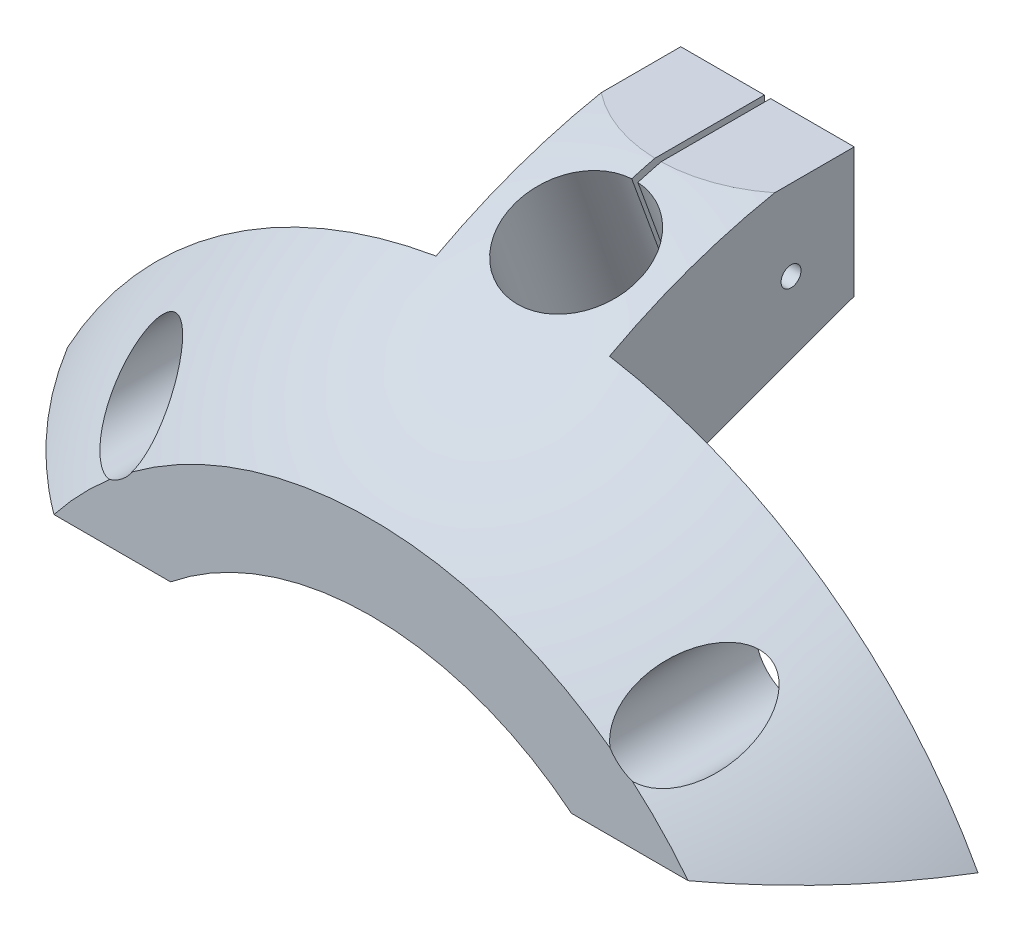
from build123d import *

# Parameters (mm, degrees)
SKETCH1_W                  = 304.8
SKETCH1_H                  = 304.8
EXTRUDE1_DEPTH             = 152.4
CUT_EXTRUDE2_DEPTH         = 264.964543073
CUT_EXTRUDE2_DEPTH_BACK    = 264.964543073
SKETCH4_OUTSIDE_W          = 398.24
SKETCH4_OUTSIDE_H          = 245.84
CUT_EXTRUDE3_DEPTH         = 250.392485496
CUT_EXTRUDE3_DEPTH_BACK    = 250.392485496
SKETCH6_W                  = 352.602414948
SKETCH6_H                  = 63.5
CUT_EXTRUDE5_DEPTH         = 203.2
SKETCH15_W                 = 148.499350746
SKETCH15_H                 = 190.401535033
SKETCH15_W_2               = 203.716743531
SKETCH15_H_2               = 154.876901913
CUT_EXTRUDE16_DEPTH        = 242.172887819
SKETCH11_R                 = 16.271875
PAR_CUT_EXTRUDE7_DEPTH     = 229.113133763
SKETCH14_R                 = 11.1125
BAIL_HOLES_DEPTH           = 59.53125
SKETCH16_W                 = 1.5875
SKETCH16_H                 = 65.942018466
SLOT_DEPTH                 = 242.171510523
CUT_EXTRUDE19_DEPTH        = 242.171510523
CUT_EXTRUDE19_DEPTH_BACK   = 242.171510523
F_10_CLEARANCE_HOLE1_D     = 5.1054
F_10_CLEARANCE_HOLE1_DEPTH = 21.43125
F_10_32_TAPPED_HOLE1_D     = 4.0386


with BuildPart() as part:
    # Sketch1 → Extrude1 (new body)
    with BuildSketch(Plane(origin=(0, 0, 0), x_dir=(1, 0, 0), z_dir=(0, 1, 0))):
        Rectangle(SKETCH1_W, SKETCH1_H)
    extrude(amount=EXTRUDE1_DEPTH)

    # Sketch4 outside → Cut-Extrude2 (cut, two sides: drawn at the far end of the back side and taken through both)
    with BuildSketch(Plane.XY.offset(-CUT_EXTRUDE2_DEPTH_BACK)):
        with Locations((0, 76.2)):
            Rectangle(SKETCH4_OUTSIDE_W, SKETCH4_OUTSIDE_H)
        with BuildLine():
            Line((-132.8166, 0), (-81.676875, 0))
            ThreePointArc((-81.676875, 0), (0, 81.676875), (81.676875, 0))
            Line((81.676875, 0), (132.8166, 0))
            ThreePointArc((132.8166, 0), (102.75994855, 84.146551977), (26.19375, 130.208051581))
            Line((26.19375, 130.208051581), (26.19375, 146.05))
            Line((26.19375, 146.05), (-26.19375, 146.05))
            Line((-26.19375, 146.05), (-26.19375, 130.208051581))
            ThreePointArc((-26.19375, 130.208051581), (-102.75994855, 84.146551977), (-132.8166, 0))
        make_face(mode=Mode.SUBTRACT)
    extrude(amount=CUT_EXTRUDE2_DEPTH + CUT_EXTRUDE2_DEPTH_BACK, mode=Mode.SUBTRACT)

    # Sketch5 → Cut-Revolve3 (revolve, cut)
    with BuildSketch(Plane(origin=(0, 0, 0), x_dir=(0, 0, -1), z_dir=(1, 0, 0))):
        with BuildLine():
            Line((-48.678693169, 158.505763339), (-171.536093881, 158.505763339))
            Line((-171.536093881, 158.505763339), (-171.536093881, 103.124))
            Line((-171.536093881, 103.124), (-152.4, 103.124))
            ThreePointArc((-152.4, 103.124), (-105.179962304, 136.91617), (-48.678693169, 150.30457167))
            Line((-48.678693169, 150.30457167), (-48.678693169, 158.505763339))
        make_face()
    revolve(axis=Axis((0, 0, 0), (0, 0, 1)), mode=Mode.SUBTRACT)

    # Sketch6 → Cut-Extrude3 (cut, two sides: drawn at the far end of the back side and taken through both)
    with BuildSketch(Plane(origin=(0, 0, 0), x_dir=(0, 0, -1), z_dir=(1, 0, 0)).offset(-CUT_EXTRUDE3_DEPTH_BACK)):
        with Locations((-0.636007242, 31.75)):
            Rectangle(SKETCH6_W, SKETCH6_H)
    extrude(amount=CUT_EXTRUDE3_DEPTH + CUT_EXTRUDE3_DEPTH_BACK, mode=Mode.SUBTRACT)

    # Sketch8 → Cut-Extrude5 (cut)
    with BuildSketch(Plane(origin=(0, 0, -152.4), x_dir=(-1, 0, 0), z_dir=(0, 0, -1))):
        with BuildLine():
            Line((-116.653329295, 63.5), (-51.369854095, 63.5))
            ThreePointArc((-51.369854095, 63.5), (0, 81.676875), (51.369854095, 63.5))
            Line((51.369854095, 63.5), (116.653329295, 63.5))
            ThreePointArc((116.653329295, 63.5), (78.827742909, 106.894509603), (26.19375, 130.208051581))
            Line((26.19375, 130.208051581), (26.19375, 146.05))
            Line((26.19375, 146.05), (-26.19375, 146.05))
            Line((-26.19375, 146.05), (-26.19375, 130.208051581))
            ThreePointArc((-26.19375, 130.208051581), (-78.827742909, 106.894509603), (-116.653329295, 63.5))
        make_face()
    extrude(amount=-CUT_EXTRUDE5_DEPTH, mode=Mode.SUBTRACT)

    # Sketch15 → Cut-Extrude16 (cut, through all)
    with BuildSketch(Plane(origin=(0, 0, 0), x_dir=(1, 0, 0), z_dir=(0, 1, 0))):
        with Locations((96.474675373, -18.305482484)):
            Rectangle(SKETCH15_W, SKETCH15_H)
        with Locations((-124.083371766, -36.067799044)):
            Rectangle(SKETCH15_W_2, SKETCH15_H_2)
    extrude(amount=CUT_EXTRUDE16_DEPTH, mode=Mode.SUBTRACT)

    # Sketch11 → PAR Cut-Extrude7 (cut, through all)
    with BuildSketch(Plane(origin=(0, 15.916594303, 5.793166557), x_dir=(1, 0, 0), z_dir=(0, -0.939692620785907, -0.34202014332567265))):
        with Locations(Location((0, 46.537008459, 0), (0, 0, 270))):
            Circle(SKETCH11_R)
    extrude(amount=-PAR_CUT_EXTRUDE7_DEPTH, mode=Mode.SUBTRACT)

    # Sketch14 → Bail Holes (cut)
    with BuildSketch(Plane.XY.offset(152.4)):
        with Locations(Location((-70.64375, 88.9, 0), (0, 0, 327.714235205))):
            Circle(SKETCH14_R)
        with Locations(Location((70.64375, 88.9, 0), (0, 0, 250.76991722))):
            Circle(SKETCH14_R)
    extrude(amount=-BAIL_HOLES_DEPTH, mode=Mode.SUBTRACT)

    # Sketch16 → Slot (cut, through all)
    with BuildSketch(Plane(origin=(0, 0, 0), x_dir=(1, 0, 0), z_dir=(0, 1, 0))):
        with Locations((0, -59.358633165)):
            Rectangle(SKETCH16_W, SKETCH16_H)
    extrude(amount=SLOT_DEPTH, mode=Mode.SUBTRACT)

    # Sketch17 → Cut-Extrude19 (cut, two sides: drawn at the far end of the back side and taken through both)
    with BuildSketch(Plane(origin=(0, 0, 0), x_dir=(0, 0, -1), z_dir=(1, 0, 0)).offset(-CUT_EXTRUDE19_DEPTH_BACK)):
        Polygon((-35.652418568, 118.399254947), (-35.652418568, 77.362777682), (-113.50625, 77.362777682), (-113.50625, 90.062777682), align=None)
    extrude(amount=CUT_EXTRUDE19_DEPTH + CUT_EXTRUDE19_DEPTH_BACK, mode=Mode.SUBTRACT)

    # 10 Clearance Hole1
    with Locations(Plane(origin=(22.225, 5.166169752, 10.073761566), x_dir=(0, 0, -1), z_dir=(1, 0, 0))):
        with Locations((-56.918796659, 120.246330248)):
            Hole(F_10_CLEARANCE_HOLE1_D / 2, depth=F_10_CLEARANCE_HOLE1_DEPTH)

    # 10-32 Tapped Hole1 (through all)
    with Locations(Plane(origin=(-0.79375, 0, 0), x_dir=(0, 0, -1), z_dir=(1, 0, 0))):
        with Locations((-66.992558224, 125.4125)):
            Hole(F_10_32_TAPPED_HOLE1_D / 2)


solid = part.part
